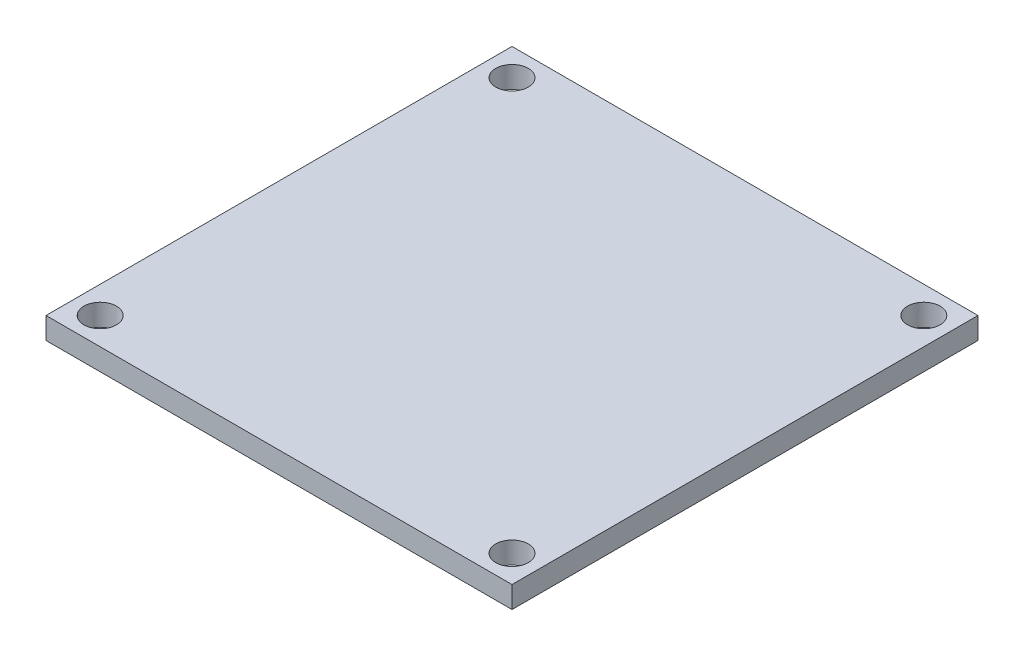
from build123d import *

# Parameters (mm, degrees)
SKETCH1_W           = 43
SKETCH1_H           = 43
BOSS_EXTRUDE1_DEPTH = 2
SKETCH2_R           = 1.5
CUT_EXTRUDE1_DEPTH  = 2


with BuildPart() as part:
    # Sketch1 → Boss-Extrude1 (new body)
    with BuildSketch(Plane(origin=(0, 0, 0), x_dir=(1, 0, 0), z_dir=(0, 1, 0))):
        Rectangle(SKETCH1_W, SKETCH1_H)
    extrude(amount=BOSS_EXTRUDE1_DEPTH)

    # Sketch2 → Cut-Extrude1 (cut)
    with BuildSketch(Plane(origin=(0, 2, 0), x_dir=(1, 0, 0), z_dir=(0, 1, 0))):
        with Locations(Location((-19, 19, 0), (0, 0, 270))):
            Circle(SKETCH2_R)
        with Locations(Location((19, 19, 0), (0, 0, 270))):
            Circle(SKETCH2_R)
        with Locations(Location((-19, -19, 0), (0, 0, 270))):
            Circle(SKETCH2_R)
        with Locations(Location((19, -19, 0), (0, 0, 270))):
            Circle(SKETCH2_R)
    extrude(amount=-CUT_EXTRUDE1_DEPTH, mode=Mode.SUBTRACT)


solid = part.part
